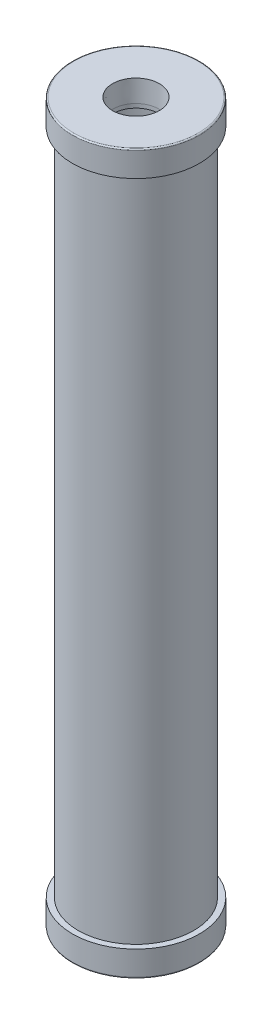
ISO-10303-21;
HEADER;
FILE_DESCRIPTION(('STEP AP214'),'2;1');
FILE_NAME('part.step','',(''),(''),'','','');
FILE_SCHEMA(('AUTOMOTIVE_DESIGN { 1 0 10303 214 1 1 1 1 }'));
ENDSEC;
DATA;
#1=APPLICATION_CONTEXT('core data for automotive mechanical design processes');
#2=APPLICATION_PROTOCOL_DEFINITION('international standard','automotive_design',2000,#1);
#3=PRODUCT_CONTEXT('',#1,'mechanical');
#4=PRODUCT('Part','Part','',(#3));
#5=PRODUCT_RELATED_PRODUCT_CATEGORY('part','',(#4));
#6=PRODUCT_DEFINITION_FORMATION('','',#4);
#7=PRODUCT_DEFINITION_CONTEXT('part definition',#1,'design');
#8=PRODUCT_DEFINITION('design','',#6,#7);
#9=PRODUCT_DEFINITION_SHAPE('','',#8);
#10=(LENGTH_UNIT() NAMED_UNIT(*) SI_UNIT(.MILLI.,.METRE.));
#11=(NAMED_UNIT(*) PLANE_ANGLE_UNIT() SI_UNIT($,.RADIAN.));
#12=(NAMED_UNIT(*) SI_UNIT($,.STERADIAN.) SOLID_ANGLE_UNIT());
#13=UNCERTAINTY_MEASURE_WITH_UNIT(LENGTH_MEASURE(1.E-05),#10,'distance_accuracy_value','');
#14=(GEOMETRIC_REPRESENTATION_CONTEXT(3) GLOBAL_UNCERTAINTY_ASSIGNED_CONTEXT((#13)) GLOBAL_UNIT_ASSIGNED_CONTEXT((#10,
#11,#12)) REPRESENTATION_CONTEXT('',''));
#15=CARTESIAN_POINT('',(0.,0.,0.));
#16=DIRECTION('',(0.,0.,1.));
#17=DIRECTION('',(1.,0.,0.));
#18=AXIS2_PLACEMENT_3D('',#15,#16,#17);
#19=CARTESIAN_POINT('',(0.,711.2,0.));
#20=DIRECTION('',(0.,-1.,0.));
#21=DIRECTION('',(0.,0.,-1.));
#22=AXIS2_PLACEMENT_3D('',#19,#20,#21);
#23=CYLINDRICAL_SURFACE('',#22,57.15);
#24=CARTESIAN_POINT('',(0.,25.4,0.));
#25=DIRECTION('',(0.,1.,0.));
#26=DIRECTION('',(0.,0.,1.));
#27=AXIS2_PLACEMENT_3D('',#24,#25,#26);
#28=CIRCLE('',#27,57.15);
#29=CARTESIAN_POINT('',(0.,25.4,57.15));
#30=VERTEX_POINT('',#29);
#31=EDGE_CURVE('E71',#30,#30,#28,.T.);
#32=ORIENTED_EDGE('',*,*,#31,.T.);
#33=EDGE_LOOP('',(#32));
#34=FACE_BOUND('',#33,.T.);
#35=CARTESIAN_POINT('',(0.,685.8,0.));
#36=DIRECTION('',(0.,1.,0.));
#37=DIRECTION('',(0.,0.,1.));
#38=AXIS2_PLACEMENT_3D('',#35,#36,#37);
#39=CIRCLE('',#38,57.15);
#40=CARTESIAN_POINT('',(0.,685.8,57.15));
#41=VERTEX_POINT('',#40);
#42=EDGE_CURVE('E53',#41,#41,#39,.T.);
#43=ORIENTED_EDGE('',*,*,#42,.F.);
#44=EDGE_LOOP('',(#43));
#45=FACE_BOUND('',#44,.T.);
#46=ADVANCED_FACE('F33',(#34,#45),#23,.T.);
#47=CARTESIAN_POINT('',(0.,711.2,0.));
#48=DIRECTION('',(0.,-1.,0.));
#49=DIRECTION('',(0.,0.,-1.));
#50=AXIS2_PLACEMENT_3D('',#47,#48,#49);
#51=CYLINDRICAL_SURFACE('',#50,50.546);
#52=CARTESIAN_POINT('',(0.,25.4,0.));
#53=DIRECTION('',(0.,1.,0.));
#54=DIRECTION('',(0.,0.,1.));
#55=AXIS2_PLACEMENT_3D('',#52,#53,#54);
#56=CIRCLE('',#55,50.546);
#57=CARTESIAN_POINT('',(0.,25.4,50.546));
#58=VERTEX_POINT('',#57);
#59=EDGE_CURVE('E68',#58,#58,#56,.T.);
#60=ORIENTED_EDGE('',*,*,#59,.F.);
#61=EDGE_LOOP('',(#60));
#62=FACE_BOUND('',#61,.T.);
#63=CARTESIAN_POINT('',(0.,685.8,0.));
#64=DIRECTION('',(0.,1.,0.));
#65=DIRECTION('',(0.,0.,1.));
#66=AXIS2_PLACEMENT_3D('',#63,#64,#65);
#67=CIRCLE('',#66,50.546);
#68=CARTESIAN_POINT('',(0.,685.8,50.546));
#69=VERTEX_POINT('',#68);
#70=EDGE_CURVE('E59',#69,#69,#67,.T.);
#71=ORIENTED_EDGE('',*,*,#70,.T.);
#72=EDGE_LOOP('',(#71));
#73=FACE_BOUND('',#72,.T.);
#74=ADVANCED_FACE('F115',(#62,#73),#51,.F.);
#75=CARTESIAN_POINT('',(0.,25.4,0.));
#76=DIRECTION('',(0.,1.,0.));
#77=DIRECTION('',(0.,0.,1.));
#78=AXIS2_PLACEMENT_3D('',#75,#76,#77);
#79=PLANE('',#78);
#80=CARTESIAN_POINT('',(0.,25.4,0.));
#81=DIRECTION('',(0.,1.,0.));
#82=DIRECTION('',(0.,0.,1.));
#83=AXIS2_PLACEMENT_3D('',#80,#81,#82);
#84=CIRCLE('',#83,22.6);
#85=CARTESIAN_POINT('',(0.,25.4,22.6));
#86=VERTEX_POINT('',#85);
#87=EDGE_CURVE('E63',#86,#86,#84,.T.);
#88=ORIENTED_EDGE('',*,*,#87,.F.);
#89=EDGE_LOOP('',(#88));
#90=FACE_BOUND('',#89,.T.);
#91=ORIENTED_EDGE('',*,*,#59,.T.);
#92=EDGE_LOOP('',(#91));
#93=FACE_BOUND('',#92,.T.);
#94=ADVANCED_FACE('F121',(#90,#93),#79,.T.);
#95=CARTESIAN_POINT('',(0.,25.4,0.));
#96=DIRECTION('',(0.,1.,0.));
#97=DIRECTION('',(0.,0.,1.));
#98=AXIS2_PLACEMENT_3D('',#95,#96,#97);
#99=CIRCLE('',#98,62.865);
#100=CARTESIAN_POINT('',(0.,25.4,62.865));
#101=VERTEX_POINT('',#100);
#102=EDGE_CURVE('E66',#101,#101,#99,.T.);
#103=ORIENTED_EDGE('',*,*,#102,.T.);
#104=EDGE_LOOP('',(#103));
#105=FACE_BOUND('',#104,.T.);
#106=ORIENTED_EDGE('',*,*,#31,.F.);
#107=EDGE_LOOP('',(#106));
#108=FACE_BOUND('',#107,.T.);
#109=ADVANCED_FACE('F142',(#105,#108),#79,.T.);
#110=CARTESIAN_POINT('',(0.,25.4,0.));
#111=DIRECTION('',(0.,-1.,0.));
#112=DIRECTION('',(0.,0.,-1.));
#113=AXIS2_PLACEMENT_3D('',#110,#111,#112);
#114=CYLINDRICAL_SURFACE('',#113,62.865);
#115=CARTESIAN_POINT('',(0.,1.27,0.));
#116=DIRECTION('',(0.,1.,0.));
#117=DIRECTION('',(0.,0.,1.));
#118=AXIS2_PLACEMENT_3D('',#115,#116,#117);
#119=CIRCLE('',#118,62.865);
#120=CARTESIAN_POINT('',(0.,1.27,62.865));
#121=VERTEX_POINT('',#120);
#122=EDGE_CURVE('E48',#121,#121,#119,.T.);
#123=ORIENTED_EDGE('',*,*,#122,.T.);
#124=EDGE_LOOP('',(#123));
#125=FACE_BOUND('',#124,.T.);
#126=ORIENTED_EDGE('',*,*,#102,.F.);
#127=EDGE_LOOP('',(#126));
#128=FACE_BOUND('',#127,.T.);
#129=ADVANCED_FACE('F139',(#125,#128),#114,.T.);
#130=CARTESIAN_POINT('',(0.,0.,0.));
#131=DIRECTION('',(0.,1.,0.));
#132=DIRECTION('',(0.,0.,1.));
#133=AXIS2_PLACEMENT_3D('',#130,#131,#132);
#134=PLANE('',#133);
#135=CARTESIAN_POINT('',(0.,0.,0.));
#136=DIRECTION('',(0.,1.,0.));
#137=DIRECTION('',(0.,0.,1.));
#138=AXIS2_PLACEMENT_3D('',#135,#136,#137);
#139=CIRCLE('',#138,61.595);
#140=CARTESIAN_POINT('',(0.,0.,61.595));
#141=VERTEX_POINT('',#140);
#142=EDGE_CURVE('E44',#141,#141,#139,.F.);
#143=ORIENTED_EDGE('',*,*,#142,.T.);
#144=EDGE_LOOP('',(#143));
#145=FACE_BOUND('',#144,.T.);
#146=CARTESIAN_POINT('',(0.,0.,0.));
#147=DIRECTION('',(0.,-1.,0.));
#148=DIRECTION('',(0.,0.,-1.));
#149=AXIS2_PLACEMENT_3D('',#146,#147,#148);
#150=CIRCLE('',#149,23.160002);
#151=CARTESIAN_POINT('',(0.,0.,-23.160002));
#152=VERTEX_POINT('',#151);
#153=EDGE_CURVE('E62',#152,#152,#150,.T.);
#154=ORIENTED_EDGE('',*,*,#153,.F.);
#155=EDGE_LOOP('',(#154));
#156=FACE_BOUND('',#155,.T.);
#157=ADVANCED_FACE('F124',(#145,#156),#134,.F.);
#158=CARTESIAN_POINT('',(0.,0.,0.));
#159=DIRECTION('',(0.,-1.,0.));
#160=DIRECTION('',(0.,0.,-1.));
#161=AXIS2_PLACEMENT_3D('',#158,#159,#160);
#162=CYLINDRICAL_SURFACE('',#161,22.6);
#163=ORIENTED_EDGE('',*,*,#87,.T.);
#164=EDGE_LOOP('',(#163));
#165=FACE_BOUND('',#164,.T.);
#166=CARTESIAN_POINT('',(0.,21.336,0.));
#167=DIRECTION('',(0.,-1.,0.));
#168=DIRECTION('',(0.,0.,-1.));
#169=AXIS2_PLACEMENT_3D('',#166,#167,#168);
#170=CIRCLE('',#169,22.6);
#171=CARTESIAN_POINT('',(0.,21.336,-22.6));
#172=VERTEX_POINT('',#171);
#173=EDGE_CURVE('E67',#172,#172,#170,.T.);
#174=ORIENTED_EDGE('',*,*,#173,.T.);
#175=EDGE_LOOP('',(#174));
#176=FACE_BOUND('',#175,.T.);
#177=ADVANCED_FACE('F155',(#165,#176),#162,.F.);
#178=CARTESIAN_POINT('',(22.6,21.336,0.));
#179=DIRECTION('',(0.,-1.,0.));
#180=DIRECTION('',(0.,0.,-1.));
#181=AXIS2_PLACEMENT_3D('',#178,#179,#180);
#182=PLANE('',#181);
#183=ORIENTED_EDGE('',*,*,#173,.F.);
#184=EDGE_LOOP('',(#183));
#185=FACE_BOUND('',#184,.T.);
#186=CARTESIAN_POINT('',(0.,21.336,0.));
#187=DIRECTION('',(0.,-1.,0.));
#188=DIRECTION('',(0.,0.,-1.));
#189=AXIS2_PLACEMENT_3D('',#186,#187,#188);
#190=CIRCLE('',#189,22.4939641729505);
#191=CARTESIAN_POINT('',(0.,21.336,-22.4939641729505));
#192=VERTEX_POINT('',#191);
#193=EDGE_CURVE('E78',#192,#192,#190,.T.);
#194=ORIENTED_EDGE('',*,*,#193,.T.);
#195=EDGE_LOOP('',(#194));
#196=FACE_BOUND('',#195,.T.);
#197=ADVANCED_FACE('F158',(#185,#196),#182,.F.);
#198=CARTESIAN_POINT('',(0.,0.,0.));
#199=DIRECTION('',(0.,-1.,0.));
#200=DIRECTION('',(0.,0.,-1.));
#201=AXIS2_PLACEMENT_3D('',#198,#199,#200);
#202=CONICAL_SURFACE('',#201,23.160002,0.0312064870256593);
#203=ORIENTED_EDGE('',*,*,#193,.F.);
#204=EDGE_LOOP('',(#203));
#205=FACE_BOUND('',#204,.T.);
#206=ORIENTED_EDGE('',*,*,#153,.T.);
#207=EDGE_LOOP('',(#206));
#208=FACE_BOUND('',#207,.T.);
#209=ADVANCED_FACE('F162',(#205,#208),#202,.F.);
#210=CARTESIAN_POINT('',(0.,685.8,0.));
#211=DIRECTION('',(0.,1.,0.));
#212=DIRECTION('',(0.,0.,1.));
#213=AXIS2_PLACEMENT_3D('',#210,#211,#212);
#214=PLANE('',#213);
#215=CARTESIAN_POINT('',(0.,685.8,0.));
#216=DIRECTION('',(0.,1.,0.));
#217=DIRECTION('',(0.,0.,1.));
#218=AXIS2_PLACEMENT_3D('',#215,#216,#217);
#219=CIRCLE('',#218,22.6);
#220=CARTESIAN_POINT('',(0.,685.8,22.6));
#221=VERTEX_POINT('',#220);
#222=EDGE_CURVE('E54',#221,#221,#219,.T.);
#223=ORIENTED_EDGE('',*,*,#222,.T.);
#224=EDGE_LOOP('',(#223));
#225=FACE_BOUND('',#224,.T.);
#226=ORIENTED_EDGE('',*,*,#70,.F.);
#227=EDGE_LOOP('',(#226));
#228=FACE_BOUND('',#227,.T.);
#229=ADVANCED_FACE('F165',(#225,#228),#214,.F.);
#230=CARTESIAN_POINT('',(0.,685.8,0.));
#231=DIRECTION('',(0.,1.,0.));
#232=DIRECTION('',(0.,0.,1.));
#233=AXIS2_PLACEMENT_3D('',#230,#231,#232);
#234=CIRCLE('',#233,62.865);
#235=CARTESIAN_POINT('',(0.,685.8,62.865));
#236=VERTEX_POINT('',#235);
#237=EDGE_CURVE('E57',#236,#236,#234,.T.);
#238=ORIENTED_EDGE('',*,*,#237,.F.);
#239=EDGE_LOOP('',(#238));
#240=FACE_BOUND('',#239,.T.);
#241=ORIENTED_EDGE('',*,*,#42,.T.);
#242=EDGE_LOOP('',(#241));
#243=FACE_BOUND('',#242,.T.);
#244=ADVANCED_FACE('F110',(#240,#243),#214,.F.);
#245=CARTESIAN_POINT('',(0.,685.8,0.));
#246=DIRECTION('',(0.,1.,0.));
#247=DIRECTION('',(0.,0.,1.));
#248=AXIS2_PLACEMENT_3D('',#245,#246,#247);
#249=CYLINDRICAL_SURFACE('',#248,62.865);
#250=CARTESIAN_POINT('',(0.,709.93,0.));
#251=DIRECTION('',(0.,1.,0.));
#252=DIRECTION('',(0.,0.,1.));
#253=AXIS2_PLACEMENT_3D('',#250,#251,#252);
#254=CIRCLE('',#253,62.865);
#255=CARTESIAN_POINT('',(0.,709.93,62.865));
#256=VERTEX_POINT('',#255);
#257=EDGE_CURVE('E10',#256,#256,#254,.F.);
#258=ORIENTED_EDGE('',*,*,#257,.T.);
#259=EDGE_LOOP('',(#258));
#260=FACE_BOUND('',#259,.T.);
#261=ORIENTED_EDGE('',*,*,#237,.T.);
#262=EDGE_LOOP('',(#261));
#263=FACE_BOUND('',#262,.T.);
#264=ADVANCED_FACE('F101',(#260,#263),#249,.T.);
#265=CARTESIAN_POINT('',(0.,711.2,0.));
#266=DIRECTION('',(0.,1.,0.));
#267=DIRECTION('',(0.,0.,1.));
#268=AXIS2_PLACEMENT_3D('',#265,#266,#267);
#269=PLANE('',#268);
#270=CARTESIAN_POINT('',(0.,711.2,0.));
#271=DIRECTION('',(0.,1.,0.));
#272=DIRECTION('',(0.,0.,1.));
#273=AXIS2_PLACEMENT_3D('',#270,#271,#272);
#274=CIRCLE('',#273,61.595);
#275=CARTESIAN_POINT('',(0.,711.2,61.595));
#276=VERTEX_POINT('',#275);
#277=EDGE_CURVE('E40',#276,#276,#274,.T.);
#278=ORIENTED_EDGE('',*,*,#277,.T.);
#279=EDGE_LOOP('',(#278));
#280=FACE_BOUND('',#279,.T.);
#281=CARTESIAN_POINT('',(0.,711.2,0.));
#282=DIRECTION('',(0.,1.,0.));
#283=DIRECTION('',(0.,0.,1.));
#284=AXIS2_PLACEMENT_3D('',#281,#282,#283);
#285=CIRCLE('',#284,23.160002);
#286=CARTESIAN_POINT('',(0.,711.2,23.160002));
#287=VERTEX_POINT('',#286);
#288=EDGE_CURVE('E92',#287,#287,#285,.T.);
#289=ORIENTED_EDGE('',*,*,#288,.F.);
#290=EDGE_LOOP('',(#289));
#291=FACE_BOUND('',#290,.T.);
#292=ADVANCED_FACE('F98',(#280,#291),#269,.T.);
#293=CARTESIAN_POINT('',(0.,711.2,0.));
#294=DIRECTION('',(0.,1.,0.));
#295=DIRECTION('',(0.,0.,1.));
#296=AXIS2_PLACEMENT_3D('',#293,#294,#295);
#297=CYLINDRICAL_SURFACE('',#296,22.6);
#298=CARTESIAN_POINT('',(0.,689.864,0.));
#299=DIRECTION('',(0.,1.,0.));
#300=DIRECTION('',(0.,0.,1.));
#301=AXIS2_PLACEMENT_3D('',#298,#299,#300);
#302=CIRCLE('',#301,22.6);
#303=CARTESIAN_POINT('',(0.,689.864,22.6));
#304=VERTEX_POINT('',#303);
#305=EDGE_CURVE('E58',#304,#304,#302,.T.);
#306=ORIENTED_EDGE('',*,*,#305,.T.);
#307=EDGE_LOOP('',(#306));
#308=FACE_BOUND('',#307,.T.);
#309=ORIENTED_EDGE('',*,*,#222,.F.);
#310=EDGE_LOOP('',(#309));
#311=FACE_BOUND('',#310,.T.);
#312=ADVANCED_FACE('F100',(#308,#311),#297,.F.);
#313=CARTESIAN_POINT('',(22.6,689.864,0.));
#314=DIRECTION('',(0.,1.,0.));
#315=DIRECTION('',(0.,0.,1.));
#316=AXIS2_PLACEMENT_3D('',#313,#314,#315);
#317=PLANE('',#316);
#318=ORIENTED_EDGE('',*,*,#305,.F.);
#319=EDGE_LOOP('',(#318));
#320=FACE_BOUND('',#319,.T.);
#321=CARTESIAN_POINT('',(0.,689.864,0.));
#322=DIRECTION('',(0.,1.,0.));
#323=DIRECTION('',(0.,0.,1.));
#324=AXIS2_PLACEMENT_3D('',#321,#322,#323);
#325=CIRCLE('',#324,22.4939641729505);
#326=CARTESIAN_POINT('',(0.,689.864,22.4939641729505));
#327=VERTEX_POINT('',#326);
#328=EDGE_CURVE('E89',#327,#327,#325,.T.);
#329=ORIENTED_EDGE('',*,*,#328,.T.);
#330=EDGE_LOOP('',(#329));
#331=FACE_BOUND('',#330,.T.);
#332=ADVANCED_FACE('F107',(#320,#331),#317,.F.);
#333=CARTESIAN_POINT('',(0.,711.2,0.));
#334=DIRECTION('',(0.,1.,0.));
#335=DIRECTION('',(0.,0.,1.));
#336=AXIS2_PLACEMENT_3D('',#333,#334,#335);
#337=CONICAL_SURFACE('',#336,23.160002,0.0312064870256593);
#338=ORIENTED_EDGE('',*,*,#328,.F.);
#339=EDGE_LOOP('',(#338));
#340=FACE_BOUND('',#339,.T.);
#341=ORIENTED_EDGE('',*,*,#288,.T.);
#342=EDGE_LOOP('',(#341));
#343=FACE_BOUND('',#342,.T.);
#344=ADVANCED_FACE('F96',(#340,#343),#337,.F.);
#345=CARTESIAN_POINT('',(0.,1.27,0.));
#346=DIRECTION('',(0.,1.,0.));
#347=DIRECTION('',(0.,0.,1.));
#348=AXIS2_PLACEMENT_3D('',#345,#346,#347);
#349=TOROIDAL_SURFACE('',#348,61.595,1.27);
#350=ORIENTED_EDGE('',*,*,#142,.F.);
#351=EDGE_LOOP('',(#350));
#352=FACE_BOUND('',#351,.T.);
#353=ORIENTED_EDGE('',*,*,#122,.F.);
#354=EDGE_LOOP('',(#353));
#355=FACE_BOUND('',#354,.T.);
#356=ADVANCED_FACE('F125',(#352,#355),#349,.T.);
#357=CARTESIAN_POINT('',(0.,709.93,0.));
#358=DIRECTION('',(0.,1.,0.));
#359=DIRECTION('',(0.,0.,1.));
#360=AXIS2_PLACEMENT_3D('',#357,#358,#359);
#361=TOROIDAL_SURFACE('',#360,61.595,1.27);
#362=ORIENTED_EDGE('',*,*,#257,.F.);
#363=EDGE_LOOP('',(#362));
#364=FACE_BOUND('',#363,.T.);
#365=ORIENTED_EDGE('',*,*,#277,.F.);
#366=EDGE_LOOP('',(#365));
#367=FACE_BOUND('',#366,.T.);
#368=ADVANCED_FACE('F35',(#364,#367),#361,.T.);
#369=CLOSED_SHELL('',(#46,#74,#94,#109,#129,#157,#177,#197,#209,#229,#244,#264,#292,#312,#332,
#344,#356,#368));
#370=MANIFOLD_SOLID_BREP('B2',#369);
#371=ADVANCED_BREP_SHAPE_REPRESENTATION('',(#18,#370),#14);
#372=SHAPE_DEFINITION_REPRESENTATION(#9,#371);
ENDSEC;
END-ISO-10303-21;
